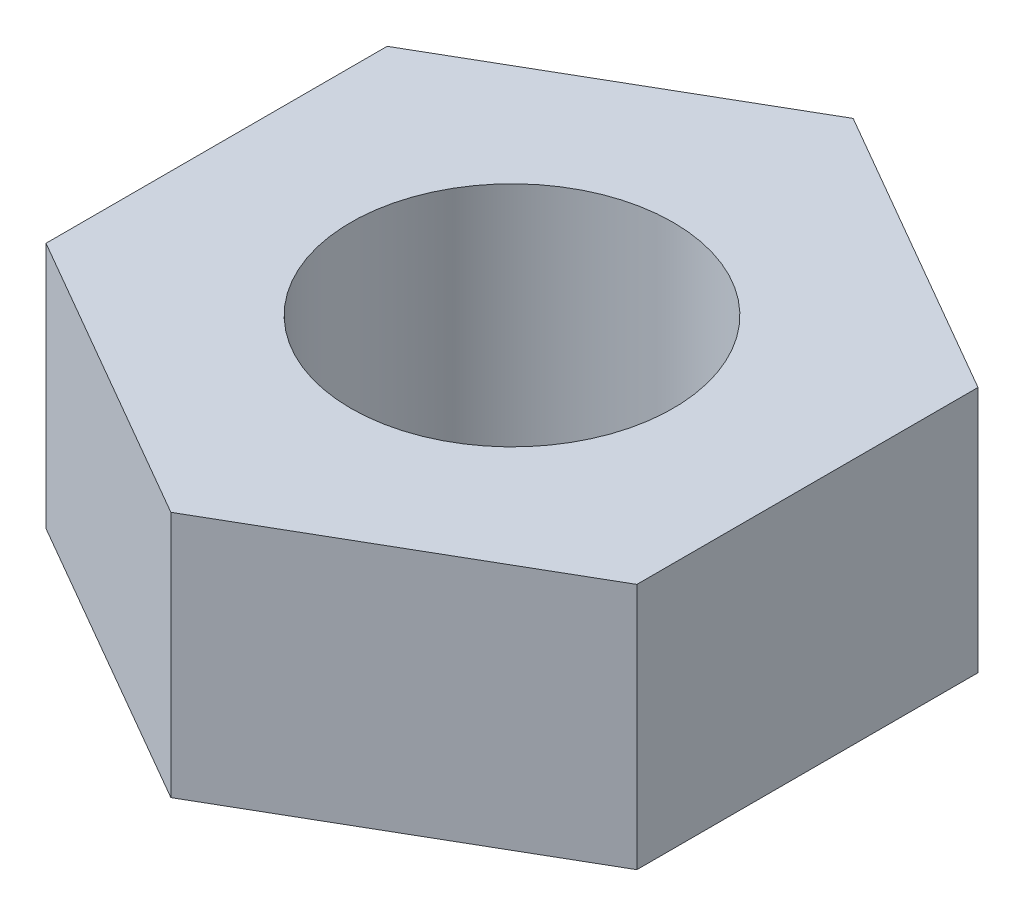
from build123d import *

# Parameters (mm, degrees)
SKETCH1_R           = 1.5
BOSS_EXTRUDE1_DEPTH = 2.3


with BuildPart() as part:
    # Sketch1 → Boss-Extrude1 (new body)
    with BuildSketch(Plane(origin=(0, 0, 0), x_dir=(1, 0, 0), z_dir=(0, 1, 0))):
        Polygon((0, 3.175426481), (-2.75, 1.58771324), (-2.75, -1.58771324), (0, -3.175426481), (2.75, -1.58771324), (2.75, 1.58771324), align=None)
        with Locations(Location((0, 0, 0), (0, 0, 270))):
            Circle(SKETCH1_R, mode=Mode.SUBTRACT)
    extrude(amount=BOSS_EXTRUDE1_DEPTH)


solid = part.part
